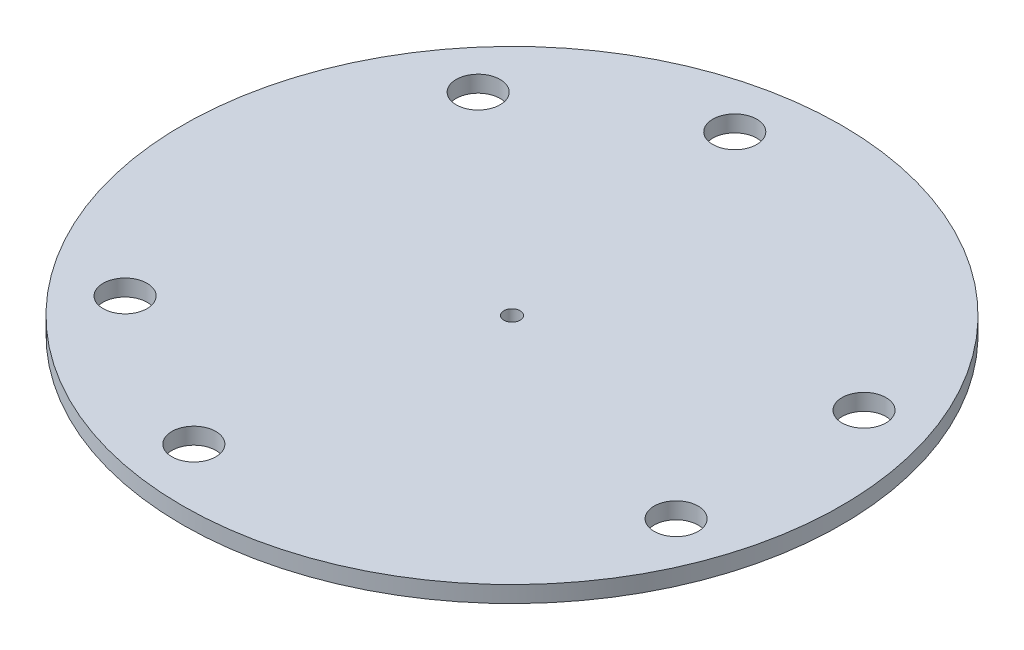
ISO-10303-21;
HEADER;
FILE_DESCRIPTION(('STEP AP214'),'2;1');
FILE_NAME('part.step','',(''),(''),'','','');
FILE_SCHEMA(('AUTOMOTIVE_DESIGN { 1 0 10303 214 1 1 1 1 }'));
ENDSEC;
DATA;
#1=APPLICATION_CONTEXT('core data for automotive mechanical design processes');
#2=APPLICATION_PROTOCOL_DEFINITION('international standard','automotive_design',2000,#1);
#3=PRODUCT_CONTEXT('',#1,'mechanical');
#4=PRODUCT('Part','Part','',(#3));
#5=PRODUCT_RELATED_PRODUCT_CATEGORY('part','',(#4));
#6=PRODUCT_DEFINITION_FORMATION('','',#4);
#7=PRODUCT_DEFINITION_CONTEXT('part definition',#1,'design');
#8=PRODUCT_DEFINITION('design','',#6,#7);
#9=PRODUCT_DEFINITION_SHAPE('','',#8);
#10=(LENGTH_UNIT() NAMED_UNIT(*) SI_UNIT(.MILLI.,.METRE.));
#11=(NAMED_UNIT(*) PLANE_ANGLE_UNIT() SI_UNIT($,.RADIAN.));
#12=(NAMED_UNIT(*) SI_UNIT($,.STERADIAN.) SOLID_ANGLE_UNIT());
#13=UNCERTAINTY_MEASURE_WITH_UNIT(LENGTH_MEASURE(1.E-05),#10,'distance_accuracy_value','');
#14=(GEOMETRIC_REPRESENTATION_CONTEXT(3) GLOBAL_UNCERTAINTY_ASSIGNED_CONTEXT((#13)) GLOBAL_UNIT_ASSIGNED_CONTEXT((#10,
#11,#12)) REPRESENTATION_CONTEXT('',''));
#15=CARTESIAN_POINT('',(0.,0.,0.));
#16=DIRECTION('',(0.,0.,1.));
#17=DIRECTION('',(1.,0.,0.));
#18=AXIS2_PLACEMENT_3D('',#15,#16,#17);
#19=CARTESIAN_POINT('',(0.,30.,0.));
#20=DIRECTION('',(0.,1.,0.));
#21=DIRECTION('',(0.,0.,1.));
#22=AXIS2_PLACEMENT_3D('',#19,#20,#21);
#23=PLANE('',#22);
#24=CARTESIAN_POINT('',(0.,30.,0.));
#25=DIRECTION('',(0.,1.,0.));
#26=DIRECTION('',(0.,0.,1.));
#27=AXIS2_PLACEMENT_3D('',#24,#25,#26);
#28=CIRCLE('',#27,15.);
#29=CARTESIAN_POINT('',(0.,30.,15.));
#30=VERTEX_POINT('',#29);
#31=EDGE_CURVE('E83',#30,#30,#28,.T.);
#32=ORIENTED_EDGE('',*,*,#31,.F.);
#33=EDGE_LOOP('',(#32));
#34=FACE_BOUND('',#33,.T.);
#35=CARTESIAN_POINT('',(-383.022221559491,30.,321.393804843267));
#36=DIRECTION('',(0.,1.,0.));
#37=DIRECTION('',(0.866025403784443,0.,-0.499999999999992));
#38=AXIS2_PLACEMENT_3D('',#35,#36,#37);
#39=CIRCLE('',#38,40.);
#40=CARTESIAN_POINT('',(-348.381205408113,30.,301.393804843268));
#41=VERTEX_POINT('',#40);
#42=EDGE_CURVE('E77',#41,#41,#39,.T.);
#43=ORIENTED_EDGE('',*,*,#42,.F.);
#44=EDGE_LOOP('',(#43));
#45=FACE_BOUND('',#44,.T.);
#46=CARTESIAN_POINT('',(469.846310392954,30.,171.010071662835));
#47=DIRECTION('',(0.,1.,0.));
#48=DIRECTION('',(-0.866025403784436,0.,-0.500000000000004));
#49=AXIS2_PLACEMENT_3D('',#46,#47,#48);
#50=CIRCLE('',#49,40.);
#51=CARTESIAN_POINT('',(435.205294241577,30.,151.010071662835));
#52=VERTEX_POINT('',#51);
#53=EDGE_CURVE('E71',#52,#52,#50,.T.);
#54=ORIENTED_EDGE('',*,*,#53,.F.);
#55=EDGE_LOOP('',(#54));
#56=FACE_BOUND('',#55,.T.);
#57=CARTESIAN_POINT('',(-86.8240888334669,30.,-492.403876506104));
#58=DIRECTION('',(0.,1.,0.));
#59=DIRECTION('',(0.,0.,1.));
#60=AXIS2_PLACEMENT_3D('',#57,#58,#59);
#61=CIRCLE('',#60,40.);
#62=CARTESIAN_POINT('',(-86.8240888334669,30.,-452.403876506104));
#63=VERTEX_POINT('',#62);
#64=EDGE_CURVE('E65',#63,#63,#61,.T.);
#65=ORIENTED_EDGE('',*,*,#64,.F.);
#66=EDGE_LOOP('',(#65));
#67=FACE_BOUND('',#66,.T.);
#68=CARTESIAN_POINT('',(-383.022221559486,30.,-321.393804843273));
#69=DIRECTION('',(0.,1.,0.));
#70=DIRECTION('',(0.866025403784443,0.,-0.499999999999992));
#71=AXIS2_PLACEMENT_3D('',#68,#69,#70);
#72=CIRCLE('',#71,40.);
#73=CARTESIAN_POINT('',(-348.381205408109,30.,-341.393804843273));
#74=VERTEX_POINT('',#73);
#75=EDGE_CURVE('E59',#74,#74,#72,.T.);
#76=ORIENTED_EDGE('',*,*,#75,.F.);
#77=EDGE_LOOP('',(#76));
#78=FACE_BOUND('',#77,.T.);
#79=CARTESIAN_POINT('',(-86.8240888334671,30.,492.403876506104));
#80=DIRECTION('',(0.,1.,0.));
#81=DIRECTION('',(-0.866025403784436,0.,-0.500000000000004));
#82=AXIS2_PLACEMENT_3D('',#79,#80,#81);
#83=CIRCLE('',#82,40.);
#84=CARTESIAN_POINT('',(-121.465104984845,30.,472.403876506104));
#85=VERTEX_POINT('',#84);
#86=EDGE_CURVE('E53',#85,#85,#83,.T.);
#87=ORIENTED_EDGE('',*,*,#86,.F.);
#88=EDGE_LOOP('',(#87));
#89=FACE_BOUND('',#88,.T.);
#90=CARTESIAN_POINT('',(469.846310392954,30.,-171.010071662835));
#91=DIRECTION('',(0.,1.,0.));
#92=DIRECTION('',(0.,0.,1.));
#93=AXIS2_PLACEMENT_3D('',#90,#91,#92);
#94=CIRCLE('',#93,40.);
#95=CARTESIAN_POINT('',(469.846310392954,30.,-131.010071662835));
#96=VERTEX_POINT('',#95);
#97=EDGE_CURVE('E47',#96,#96,#94,.T.);
#98=ORIENTED_EDGE('',*,*,#97,.F.);
#99=EDGE_LOOP('',(#98));
#100=FACE_BOUND('',#99,.T.);
#101=CARTESIAN_POINT('',(0.,30.,0.));
#102=DIRECTION('',(0.,-1.,0.));
#103=DIRECTION('',(0.,0.,-1.));
#104=AXIS2_PLACEMENT_3D('',#101,#102,#103);
#105=CIRCLE('',#104,600.);
#106=CARTESIAN_POINT('',(0.,30.,-600.));
#107=VERTEX_POINT('',#106);
#108=EDGE_CURVE('E10',#107,#107,#105,.T.);
#109=ORIENTED_EDGE('',*,*,#108,.F.);
#110=EDGE_LOOP('',(#109));
#111=FACE_BOUND('',#110,.T.);
#112=ADVANCED_FACE('F33',(#34,#45,#56,#67,#78,#89,#100,#111),#23,.T.);
#113=CARTESIAN_POINT('',(0.,-34.9782122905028,0.));
#114=DIRECTION('',(0.,-1.,0.));
#115=DIRECTION('',(0.,0.,-1.));
#116=AXIS2_PLACEMENT_3D('',#113,#114,#115);
#117=CYLINDRICAL_SURFACE('',#116,600.);
#118=ORIENTED_EDGE('',*,*,#108,.T.);
#119=EDGE_LOOP('',(#118));
#120=FACE_BOUND('',#119,.T.);
#121=CARTESIAN_POINT('',(0.,0.,0.));
#122=DIRECTION('',(0.,-1.,0.));
#123=DIRECTION('',(0.,0.,-1.));
#124=AXIS2_PLACEMENT_3D('',#121,#122,#123);
#125=CIRCLE('',#124,600.);
#126=CARTESIAN_POINT('',(0.,0.,-600.));
#127=VERTEX_POINT('',#126);
#128=EDGE_CURVE('E39',#127,#127,#125,.T.);
#129=ORIENTED_EDGE('',*,*,#128,.F.);
#130=EDGE_LOOP('',(#129));
#131=FACE_BOUND('',#130,.T.);
#132=ADVANCED_FACE('F101',(#120,#131),#117,.T.);
#133=CARTESIAN_POINT('',(0.,0.,0.));
#134=DIRECTION('',(0.,-1.,0.));
#135=DIRECTION('',(0.,0.,-1.));
#136=AXIS2_PLACEMENT_3D('',#133,#134,#135);
#137=PLANE('',#136);
#138=CARTESIAN_POINT('',(0.,0.,0.));
#139=DIRECTION('',(0.,1.,0.));
#140=DIRECTION('',(0.,0.,1.));
#141=AXIS2_PLACEMENT_3D('',#138,#139,#140);
#142=CIRCLE('',#141,15.);
#143=CARTESIAN_POINT('',(0.,0.,15.));
#144=VERTEX_POINT('',#143);
#145=EDGE_CURVE('E80',#144,#144,#142,.T.);
#146=ORIENTED_EDGE('',*,*,#145,.T.);
#147=EDGE_LOOP('',(#146));
#148=FACE_BOUND('',#147,.T.);
#149=CARTESIAN_POINT('',(-383.022221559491,0.,321.393804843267));
#150=DIRECTION('',(0.,1.,0.));
#151=DIRECTION('',(0.866025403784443,0.,-0.499999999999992));
#152=AXIS2_PLACEMENT_3D('',#149,#150,#151);
#153=CIRCLE('',#152,40.);
#154=CARTESIAN_POINT('',(-348.381205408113,0.,301.393804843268));
#155=VERTEX_POINT('',#154);
#156=EDGE_CURVE('E74',#155,#155,#153,.T.);
#157=ORIENTED_EDGE('',*,*,#156,.T.);
#158=EDGE_LOOP('',(#157));
#159=FACE_BOUND('',#158,.T.);
#160=CARTESIAN_POINT('',(469.846310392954,0.,171.010071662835));
#161=DIRECTION('',(0.,1.,0.));
#162=DIRECTION('',(-0.866025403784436,0.,-0.500000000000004));
#163=AXIS2_PLACEMENT_3D('',#160,#161,#162);
#164=CIRCLE('',#163,40.);
#165=CARTESIAN_POINT('',(435.205294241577,0.,151.010071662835));
#166=VERTEX_POINT('',#165);
#167=EDGE_CURVE('E68',#166,#166,#164,.T.);
#168=ORIENTED_EDGE('',*,*,#167,.T.);
#169=EDGE_LOOP('',(#168));
#170=FACE_BOUND('',#169,.T.);
#171=CARTESIAN_POINT('',(-86.8240888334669,0.,-492.403876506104));
#172=DIRECTION('',(0.,1.,0.));
#173=DIRECTION('',(0.,0.,1.));
#174=AXIS2_PLACEMENT_3D('',#171,#172,#173);
#175=CIRCLE('',#174,40.);
#176=CARTESIAN_POINT('',(-86.8240888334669,0.,-452.403876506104));
#177=VERTEX_POINT('',#176);
#178=EDGE_CURVE('E62',#177,#177,#175,.T.);
#179=ORIENTED_EDGE('',*,*,#178,.T.);
#180=EDGE_LOOP('',(#179));
#181=FACE_BOUND('',#180,.T.);
#182=CARTESIAN_POINT('',(-383.022221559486,0.,-321.393804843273));
#183=DIRECTION('',(0.,1.,0.));
#184=DIRECTION('',(0.866025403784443,0.,-0.499999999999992));
#185=AXIS2_PLACEMENT_3D('',#182,#183,#184);
#186=CIRCLE('',#185,40.);
#187=CARTESIAN_POINT('',(-348.381205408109,0.,-341.393804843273));
#188=VERTEX_POINT('',#187);
#189=EDGE_CURVE('E56',#188,#188,#186,.T.);
#190=ORIENTED_EDGE('',*,*,#189,.T.);
#191=EDGE_LOOP('',(#190));
#192=FACE_BOUND('',#191,.T.);
#193=CARTESIAN_POINT('',(-86.8240888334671,0.,492.403876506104));
#194=DIRECTION('',(0.,1.,0.));
#195=DIRECTION('',(-0.866025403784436,0.,-0.500000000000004));
#196=AXIS2_PLACEMENT_3D('',#193,#194,#195);
#197=CIRCLE('',#196,40.);
#198=CARTESIAN_POINT('',(-121.465104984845,0.,472.403876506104));
#199=VERTEX_POINT('',#198);
#200=EDGE_CURVE('E51',#199,#199,#197,.T.);
#201=ORIENTED_EDGE('',*,*,#200,.T.);
#202=EDGE_LOOP('',(#201));
#203=FACE_BOUND('',#202,.T.);
#204=CARTESIAN_POINT('',(469.846310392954,0.,-171.010071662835));
#205=DIRECTION('',(0.,1.,0.));
#206=DIRECTION('',(0.,0.,1.));
#207=AXIS2_PLACEMENT_3D('',#204,#205,#206);
#208=CIRCLE('',#207,40.);
#209=CARTESIAN_POINT('',(469.846310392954,0.,-131.010071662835));
#210=VERTEX_POINT('',#209);
#211=EDGE_CURVE('E43',#210,#210,#208,.T.);
#212=ORIENTED_EDGE('',*,*,#211,.T.);
#213=EDGE_LOOP('',(#212));
#214=FACE_BOUND('',#213,.T.);
#215=ORIENTED_EDGE('',*,*,#128,.T.);
#216=EDGE_LOOP('',(#215));
#217=FACE_BOUND('',#216,.T.);
#218=ADVANCED_FACE('F89',(#148,#159,#170,#181,#192,#203,#214,#217),#137,.T.);
#219=CARTESIAN_POINT('',(469.846310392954,0.,-171.010071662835));
#220=DIRECTION('',(0.,1.,0.));
#221=DIRECTION('',(0.,0.,1.));
#222=AXIS2_PLACEMENT_3D('',#219,#220,#221);
#223=CYLINDRICAL_SURFACE('',#222,40.);
#224=ORIENTED_EDGE('',*,*,#211,.F.);
#225=EDGE_LOOP('',(#224));
#226=FACE_BOUND('',#225,.T.);
#227=ORIENTED_EDGE('',*,*,#97,.T.);
#228=EDGE_LOOP('',(#227));
#229=FACE_BOUND('',#228,.T.);
#230=ADVANCED_FACE('F115',(#226,#229),#223,.F.);
#231=CARTESIAN_POINT('',(-86.8240888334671,0.,492.403876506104));
#232=DIRECTION('',(0.,1.,0.));
#233=DIRECTION('',(0.,0.,1.));
#234=AXIS2_PLACEMENT_3D('',#231,#232,#233);
#235=CYLINDRICAL_SURFACE('',#234,40.);
#236=ORIENTED_EDGE('',*,*,#200,.F.);
#237=EDGE_LOOP('',(#236));
#238=FACE_BOUND('',#237,.T.);
#239=ORIENTED_EDGE('',*,*,#86,.T.);
#240=EDGE_LOOP('',(#239));
#241=FACE_BOUND('',#240,.T.);
#242=ADVANCED_FACE('F117',(#238,#241),#235,.F.);
#243=CARTESIAN_POINT('',(-383.022221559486,0.,-321.393804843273));
#244=DIRECTION('',(0.,1.,0.));
#245=DIRECTION('',(0.,0.,1.));
#246=AXIS2_PLACEMENT_3D('',#243,#244,#245);
#247=CYLINDRICAL_SURFACE('',#246,40.);
#248=ORIENTED_EDGE('',*,*,#189,.F.);
#249=EDGE_LOOP('',(#248));
#250=FACE_BOUND('',#249,.T.);
#251=ORIENTED_EDGE('',*,*,#75,.T.);
#252=EDGE_LOOP('',(#251));
#253=FACE_BOUND('',#252,.T.);
#254=ADVANCED_FACE('F124',(#250,#253),#247,.F.);
#255=CARTESIAN_POINT('',(-86.8240888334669,0.,-492.403876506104));
#256=DIRECTION('',(0.,1.,0.));
#257=DIRECTION('',(0.,0.,1.));
#258=AXIS2_PLACEMENT_3D('',#255,#256,#257);
#259=CYLINDRICAL_SURFACE('',#258,40.);
#260=ORIENTED_EDGE('',*,*,#178,.F.);
#261=EDGE_LOOP('',(#260));
#262=FACE_BOUND('',#261,.T.);
#263=ORIENTED_EDGE('',*,*,#64,.T.);
#264=EDGE_LOOP('',(#263));
#265=FACE_BOUND('',#264,.T.);
#266=ADVANCED_FACE('F165',(#262,#265),#259,.F.);
#267=CARTESIAN_POINT('',(469.846310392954,0.,171.010071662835));
#268=DIRECTION('',(0.,1.,0.));
#269=DIRECTION('',(0.,0.,1.));
#270=AXIS2_PLACEMENT_3D('',#267,#268,#269);
#271=CYLINDRICAL_SURFACE('',#270,40.);
#272=ORIENTED_EDGE('',*,*,#167,.F.);
#273=EDGE_LOOP('',(#272));
#274=FACE_BOUND('',#273,.T.);
#275=ORIENTED_EDGE('',*,*,#53,.T.);
#276=EDGE_LOOP('',(#275));
#277=FACE_BOUND('',#276,.T.);
#278=ADVANCED_FACE('F158',(#274,#277),#271,.F.);
#279=CARTESIAN_POINT('',(-383.022221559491,0.,321.393804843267));
#280=DIRECTION('',(0.,1.,0.));
#281=DIRECTION('',(0.,0.,1.));
#282=AXIS2_PLACEMENT_3D('',#279,#280,#281);
#283=CYLINDRICAL_SURFACE('',#282,40.);
#284=ORIENTED_EDGE('',*,*,#156,.F.);
#285=EDGE_LOOP('',(#284));
#286=FACE_BOUND('',#285,.T.);
#287=ORIENTED_EDGE('',*,*,#42,.T.);
#288=EDGE_LOOP('',(#287));
#289=FACE_BOUND('',#288,.T.);
#290=ADVANCED_FACE('F95',(#286,#289),#283,.F.);
#291=CARTESIAN_POINT('',(0.,0.,0.));
#292=DIRECTION('',(0.,1.,0.));
#293=DIRECTION('',(0.,0.,1.));
#294=AXIS2_PLACEMENT_3D('',#291,#292,#293);
#295=CYLINDRICAL_SURFACE('',#294,15.);
#296=ORIENTED_EDGE('',*,*,#145,.F.);
#297=EDGE_LOOP('',(#296));
#298=FACE_BOUND('',#297,.T.);
#299=ORIENTED_EDGE('',*,*,#31,.T.);
#300=EDGE_LOOP('',(#299));
#301=FACE_BOUND('',#300,.T.);
#302=ADVANCED_FACE('F92',(#298,#301),#295,.F.);
#303=CLOSED_SHELL('',(#112,#132,#218,#230,#242,#254,#266,#278,#290,#302));
#304=MANIFOLD_SOLID_BREP('B2',#303);
#305=ADVANCED_BREP_SHAPE_REPRESENTATION('',(#18,#304),#14);
#306=SHAPE_DEFINITION_REPRESENTATION(#9,#305);
ENDSEC;
END-ISO-10303-21;
